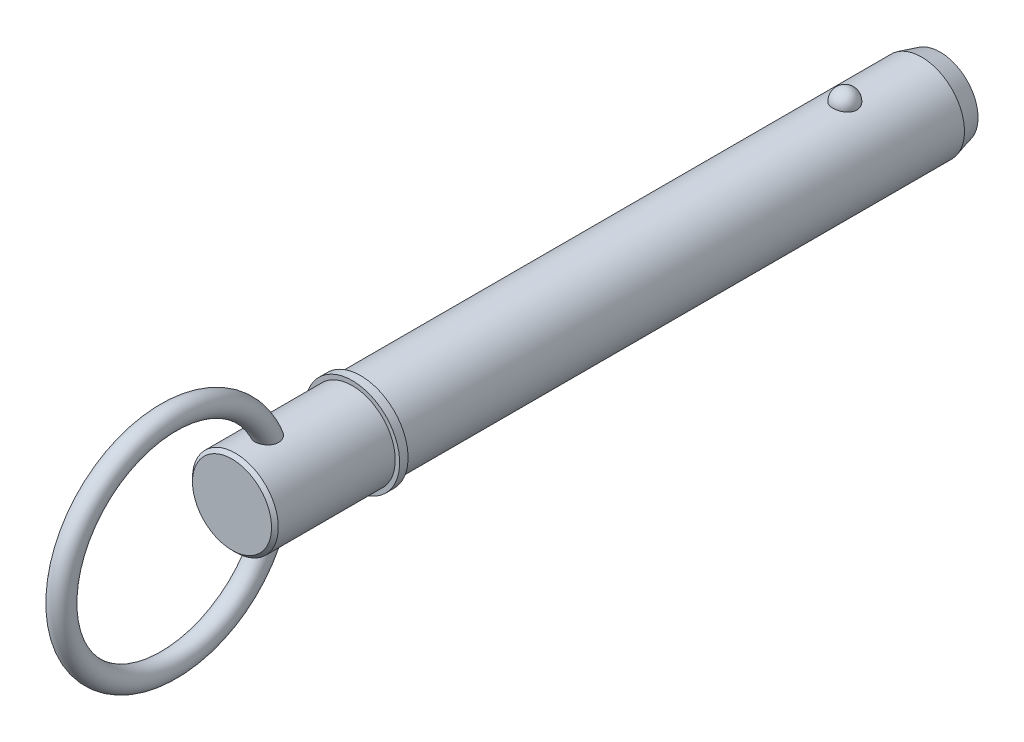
ISO-10303-21;
HEADER;
FILE_DESCRIPTION(('STEP AP214'),'2;1');
FILE_NAME('part.step','',(''),(''),'','','');
FILE_SCHEMA(('AUTOMOTIVE_DESIGN { 1 0 10303 214 1 1 1 1 }'));
ENDSEC;
DATA;
#1=APPLICATION_CONTEXT('core data for automotive mechanical design processes');
#2=APPLICATION_PROTOCOL_DEFINITION('international standard','automotive_design',2000,#1);
#3=PRODUCT_CONTEXT('',#1,'mechanical');
#4=PRODUCT('Part','Part','',(#3));
#5=PRODUCT_RELATED_PRODUCT_CATEGORY('part','',(#4));
#6=PRODUCT_DEFINITION_FORMATION('','',#4);
#7=PRODUCT_DEFINITION_CONTEXT('part definition',#1,'design');
#8=PRODUCT_DEFINITION('design','',#6,#7);
#9=PRODUCT_DEFINITION_SHAPE('','',#8);
#10=(LENGTH_UNIT() NAMED_UNIT(*) SI_UNIT(.MILLI.,.METRE.));
#11=(NAMED_UNIT(*) PLANE_ANGLE_UNIT() SI_UNIT($,.RADIAN.));
#12=(NAMED_UNIT(*) SI_UNIT($,.STERADIAN.) SOLID_ANGLE_UNIT());
#13=UNCERTAINTY_MEASURE_WITH_UNIT(LENGTH_MEASURE(1.E-05),#10,'distance_accuracy_value','');
#14=(GEOMETRIC_REPRESENTATION_CONTEXT(3) GLOBAL_UNCERTAINTY_ASSIGNED_CONTEXT((#13)) GLOBAL_UNIT_ASSIGNED_CONTEXT((#10,
#11,#12)) REPRESENTATION_CONTEXT('',''));
#15=CARTESIAN_POINT('',(0.,0.,0.));
#16=DIRECTION('',(0.,0.,1.));
#17=DIRECTION('',(1.,0.,0.));
#18=AXIS2_PLACEMENT_3D('',#15,#16,#17);
#19=CARTESIAN_POINT('',(0.,0.,139.7));
#20=DIRECTION('',(0.,0.,-1.));
#21=DIRECTION('',(-1.,0.,0.));
#22=AXIS2_PLACEMENT_3D('',#19,#20,#21);
#23=CYLINDRICAL_SURFACE('',#22,12.7);
#24=CARTESIAN_POINT('',(3.52486003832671,12.2010393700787,-3.56));
#25=CARTESIAN_POINT('',(3.52485671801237,12.2010422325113,-3.3610062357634));
#26=CARTESIAN_POINT('',(3.50863187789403,12.2057632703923,-3.16197042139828));
#27=CARTESIAN_POINT('',(3.4441205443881,12.2241207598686,-2.76953945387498));
#28=CARTESIAN_POINT('',(3.39582213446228,12.2377605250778,-2.57614642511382));
#29=CARTESIAN_POINT('',(3.26839193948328,12.2724057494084,-2.20059799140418));
#30=CARTESIAN_POINT('',(3.18927369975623,12.2934079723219,-2.01843769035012));
#31=CARTESIAN_POINT('',(3.00217139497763,12.3404306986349,-1.6703228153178));
#32=CARTESIAN_POINT('',(2.89418796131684,12.3664510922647,-1.50436788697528));
#33=CARTESIAN_POINT('',(2.65144862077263,12.4207616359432,-1.19241975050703));
#34=CARTESIAN_POINT('',(2.51656310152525,12.4490623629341,-1.04652919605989));
#35=CARTESIAN_POINT('',(2.22383249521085,12.5046678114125,-0.779711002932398));
#36=CARTESIAN_POINT('',(2.0659873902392,12.5319725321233,-0.658783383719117));
#37=CARTESIAN_POINT('',(1.73204520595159,12.5824645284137,-0.445586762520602));
#38=CARTESIAN_POINT('',(1.55600183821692,12.6056634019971,-0.353236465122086));
#39=CARTESIAN_POINT('',(1.19021695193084,12.6454411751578,-0.199381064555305));
#40=CARTESIAN_POINT('',(1.00047694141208,12.6620208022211,-0.137872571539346));
#41=CARTESIAN_POINT('',(0.616329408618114,12.6864692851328,-0.0483191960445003));
#42=CARTESIAN_POINT('',(0.422067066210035,12.6944893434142,-0.0196927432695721));
#43=CARTESIAN_POINT('',(0.0313259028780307,12.7014637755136,0.00524116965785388));
#44=CARTESIAN_POINT('',(-0.165152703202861,12.7004190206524,0.00155173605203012));
#45=CARTESIAN_POINT('',(-0.551780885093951,12.6894611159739,-0.0377454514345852));
#46=CARTESIAN_POINT('',(-0.74198078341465,12.6796749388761,-0.0728962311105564));
#47=CARTESIAN_POINT('',(-1.11361063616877,12.6524544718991,-0.173489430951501));
#48=CARTESIAN_POINT('',(-1.29504043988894,12.6350200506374,-0.238932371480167));
#49=CARTESIAN_POINT('',(-1.64521311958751,12.5942270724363,-0.398772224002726));
#50=CARTESIAN_POINT('',(-1.81387645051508,12.5708347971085,-0.493334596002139));
#51=CARTESIAN_POINT('',(-2.13292959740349,12.5206522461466,-0.708731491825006));
#52=CARTESIAN_POINT('',(-2.28331755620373,12.4938616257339,-0.829568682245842));
#53=CARTESIAN_POINT('',(-2.56470285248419,12.4391828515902,-1.0968714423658));
#54=CARTESIAN_POINT('',(-2.69527522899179,12.4112835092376,-1.24378221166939));
#55=CARTESIAN_POINT('',(-2.93023079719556,12.3579248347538,-1.55763192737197));
#56=CARTESIAN_POINT('',(-3.03461212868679,12.3324656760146,-1.72457229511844));
#57=CARTESIAN_POINT('',(-3.21564423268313,12.2865167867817,-2.07598316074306));
#58=CARTESIAN_POINT('',(-3.29196222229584,12.2660875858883,-2.26063321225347));
#59=CARTESIAN_POINT('',(-3.41323771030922,12.2328979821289,-2.64061334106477));
#60=CARTESIAN_POINT('',(-3.45819611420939,12.2201373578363,-2.83594310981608));
#61=CARTESIAN_POINT('',(-3.51550038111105,12.2037762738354,-3.2308649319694));
#62=CARTESIAN_POINT('',(-3.5279827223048,12.200137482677,-3.43043558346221));
#63=CARTESIAN_POINT('',(-3.52041430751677,12.2023234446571,-3.8289025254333));
#64=CARTESIAN_POINT('',(-3.50036443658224,12.2081479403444,-4.02779883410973));
#65=CARTESIAN_POINT('',(-3.42842010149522,12.2285446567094,-4.41824213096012));
#66=CARTESIAN_POINT('',(-3.37668525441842,12.243073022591,-4.6098208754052));
#67=CARTESIAN_POINT('',(-3.24279085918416,12.2792134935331,-4.98132360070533));
#68=CARTESIAN_POINT('',(-3.16063009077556,12.300825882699,-5.16124711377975));
#69=CARTESIAN_POINT('',(-2.96738224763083,12.3488691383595,-5.50542856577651));
#70=CARTESIAN_POINT('',(-2.85613997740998,12.3753256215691,-5.66959579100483));
#71=CARTESIAN_POINT('',(-2.60773241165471,12.4300386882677,-5.97665065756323));
#72=CARTESIAN_POINT('',(-2.47056612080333,12.458295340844,-6.11953748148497));
#73=CARTESIAN_POINT('',(-2.17327999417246,12.5135827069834,-6.38059312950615));
#74=CARTESIAN_POINT('',(-2.01307652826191,12.5406084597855,-6.49866785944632));
#75=CARTESIAN_POINT('',(-1.67442544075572,12.5902954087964,-6.70609314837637));
#76=CARTESIAN_POINT('',(-1.49597909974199,12.6129569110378,-6.79544572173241));
#77=CARTESIAN_POINT('',(-1.12819666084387,12.6511224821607,-6.94192787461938));
#78=CARTESIAN_POINT('',(-0.93902400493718,12.666712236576,-6.99944518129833));
#79=CARTESIAN_POINT('',(-0.553267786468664,12.6894125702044,-7.08227444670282));
#80=CARTESIAN_POINT('',(-0.356685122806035,12.6965241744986,-7.10759029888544));
#81=CARTESIAN_POINT('',(0.0343320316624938,12.7014305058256,-7.12510946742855));
#82=CARTESIAN_POINT('',(0.228736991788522,12.6993986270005,-7.11792901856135));
#83=CARTESIAN_POINT('',(0.613493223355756,12.6866339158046,-7.07206766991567));
#84=CARTESIAN_POINT('',(0.803844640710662,12.6759013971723,-7.03338790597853));
#85=CARTESIAN_POINT('',(1.17440741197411,12.6469443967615,-6.925834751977));
#86=CARTESIAN_POINT('',(1.35465462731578,12.6287486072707,-6.85707692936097));
#87=CARTESIAN_POINT('',(1.70092526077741,12.5867908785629,-6.69128257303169));
#88=CARTESIAN_POINT('',(1.86694777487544,12.5630285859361,-6.59424424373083));
#89=CARTESIAN_POINT('',(2.18289085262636,12.5120350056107,-6.3727748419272));
#90=CARTESIAN_POINT('',(2.33252391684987,12.4847559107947,-6.24794475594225));
#91=CARTESIAN_POINT('',(2.60889724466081,12.4299457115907,-5.97511730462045));
#92=CARTESIAN_POINT('',(2.73563353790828,12.4024145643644,-5.82711592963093));
#93=CARTESIAN_POINT('',(2.96505559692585,12.3495984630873,-5.5091226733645));
#94=CARTESIAN_POINT('',(3.06728335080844,12.3243610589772,-5.33879227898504));
#95=CARTESIAN_POINT('',(3.24218794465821,12.2795120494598,-4.98295005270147));
#96=CARTESIAN_POINT('',(3.31487538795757,12.2598984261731,-4.79744369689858));
#97=CARTESIAN_POINT('',(3.42255689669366,12.2302435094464,-4.43775244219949));
#98=CARTESIAN_POINT('',(3.46085292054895,12.2193780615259,-4.264615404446));
#99=CARTESIAN_POINT('',(3.5120056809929,12.2047747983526,-3.9143299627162));
#100=CARTESIAN_POINT('',(3.52486299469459,12.2010368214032,-3.73718164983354));
#101=CARTESIAN_POINT('',(3.52486003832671,12.2010393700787,-3.56));
#102=B_SPLINE_CURVE_WITH_KNOTS('',3,(#24,#25,#26,#27,#28,#29,#30,#31,#32,#33,#34,#35,#36,#37,
#38,#39,#40,#41,#42,#43,#44,#45,#46,#47,#48,#49,#50,#51,#52,#53,#54,#55,#56,#57,#58,#59,#60,#61,
#62,#63,#64,#65,#66,#67,#68,#69,#70,#71,#72,#73,#74,#75,#76,#77,#78,#79,#80,#81,#82,#83,#84,#85,
#86,#87,#88,#89,#90,#91,#92,#93,#94,#95,#96,#97,#98,#99,#100,#101),.UNSPECIFIED.,.T.,.F.,(4,2,2,
2,2,2,2,2,2,2,2,2,2,2,2,2,2,2,2,2,2,2,2,2,2,2,2,2,2,2,2,2,2,2,2,2,2,2,4),(0.,0.596344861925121,
1.19291141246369,1.78921606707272,2.38550767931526,2.98474477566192,3.58398233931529,
4.18149920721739,4.77895038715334,5.36566361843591,5.95232045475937,6.53059198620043,
7.10887345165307,7.6905033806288,8.27219236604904,8.86498552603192,9.45782077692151,
10.0574751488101,10.6571122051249,11.2542252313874,11.8513220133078,12.4454353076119,
13.0395724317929,13.636947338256,14.2343451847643,14.8339691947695,15.4335511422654,
16.0256602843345,16.6176978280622,17.1985559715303,17.7793931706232,18.3580179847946,
18.9366795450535,19.5242567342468,20.1119357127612,20.7098642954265,21.3075780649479,
21.8385683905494,22.3695466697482),.UNSPECIFIED.);
#103=CARTESIAN_POINT('',(3.52486003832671,12.2010393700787,-3.56));
#104=VERTEX_POINT('',#103);
#105=EDGE_CURVE('E101',#104,#104,#102,.T.);
#106=ORIENTED_EDGE('',*,*,#105,.T.);
#107=EDGE_LOOP('',(#106));
#108=FACE_BOUND('',#107,.T.);
#109=CARTESIAN_POINT('',(0.,0.,-26.25));
#110=DIRECTION('',(0.,0.,-1.));
#111=DIRECTION('',(-1.,0.,0.));
#112=AXIS2_PLACEMENT_3D('',#109,#110,#111);
#113=CIRCLE('',#112,12.7);
#114=CARTESIAN_POINT('',(-12.7,0.,-26.25));
#115=VERTEX_POINT('',#114);
#116=EDGE_CURVE('E108',#115,#115,#113,.F.);
#117=ORIENTED_EDGE('',*,*,#116,.T.);
#118=EDGE_LOOP('',(#117));
#119=FACE_BOUND('',#118,.T.);
#120=CARTESIAN_POINT('',(0.,0.,139.7));
#121=DIRECTION('',(0.,0.,1.));
#122=DIRECTION('',(1.,0.,0.));
#123=AXIS2_PLACEMENT_3D('',#120,#121,#122);
#124=CIRCLE('',#123,12.7);
#125=CARTESIAN_POINT('',(12.7,0.,139.7));
#126=VERTEX_POINT('',#125);
#127=EDGE_CURVE('E106',#126,#126,#124,.T.);
#128=ORIENTED_EDGE('',*,*,#127,.F.);
#129=EDGE_LOOP('',(#128));
#130=FACE_BOUND('',#129,.T.);
#131=ADVANCED_FACE('F39',(#108,#119,#130),#23,.T.);
#132=CARTESIAN_POINT('',(0.,0.,-31.75));
#133=DIRECTION('',(0.,0.,-1.));
#134=DIRECTION('',(-1.,0.,0.));
#135=AXIS2_PLACEMENT_3D('',#132,#133,#134);
#136=PLANE('',#135);
#137=CARTESIAN_POINT('',(0.,0.,-31.75));
#138=DIRECTION('',(0.,0.,-1.));
#139=DIRECTION('',(-1.,0.,0.));
#140=AXIS2_PLACEMENT_3D('',#137,#138,#139);
#141=CIRCLE('',#140,11.2262794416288);
#142=CARTESIAN_POINT('',(-11.2262794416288,0.,-31.75));
#143=VERTEX_POINT('',#142);
#144=EDGE_CURVE('E142',#143,#143,#141,.T.);
#145=ORIENTED_EDGE('',*,*,#144,.T.);
#146=EDGE_LOOP('',(#145));
#147=FACE_BOUND('',#146,.T.);
#148=ADVANCED_FACE('F87',(#147),#136,.T.);
#149=CARTESIAN_POINT('',(0.,0.,-31.75));
#150=DIRECTION('',(0.,0.,1.));
#151=DIRECTION('',(1.,0.,0.));
#152=AXIS2_PLACEMENT_3D('',#149,#150,#151);
#153=CONICAL_SURFACE('',#152,11.2262794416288,0.261799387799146);
#154=ORIENTED_EDGE('',*,*,#116,.F.);
#155=EDGE_LOOP('',(#154));
#156=FACE_BOUND('',#155,.T.);
#157=ORIENTED_EDGE('',*,*,#144,.F.);
#158=EDGE_LOOP('',(#157));
#159=FACE_BOUND('',#158,.T.);
#160=ADVANCED_FACE('F93',(#156,#159),#153,.T.);
#161=CARTESIAN_POINT('',(0.,12.7,-3.56));
#162=DIRECTION('',(0.,1.,0.));
#163=DIRECTION('',(0.,0.,1.));
#164=AXIS2_PLACEMENT_3D('',#161,#162,#163);
#165=SPHERICAL_SURFACE('',#164,3.56);
#166=ORIENTED_EDGE('',*,*,#105,.F.);
#167=EDGE_LOOP('',(#166));
#168=FACE_BOUND('',#167,.T.);
#169=ADVANCED_FACE('F111',(#168),#165,.T.);
#170=CARTESIAN_POINT('',(0.,0.,139.7));
#171=DIRECTION('',(0.,0.,-1.));
#172=DIRECTION('',(-1.,0.,0.));
#173=AXIS2_PLACEMENT_3D('',#170,#171,#172);
#174=PLANE('',#173);
#175=ORIENTED_EDGE('',*,*,#127,.T.);
#176=EDGE_LOOP('',(#175));
#177=FACE_BOUND('',#176,.T.);
#178=CARTESIAN_POINT('',(0.,0.,139.7));
#179=DIRECTION('',(0.,0.,-1.));
#180=DIRECTION('',(-1.,0.,0.));
#181=AXIS2_PLACEMENT_3D('',#178,#179,#180);
#182=CIRCLE('',#181,14.);
#183=CARTESIAN_POINT('',(-14.,0.,139.7));
#184=VERTEX_POINT('',#183);
#185=EDGE_CURVE('E107',#184,#184,#182,.T.);
#186=ORIENTED_EDGE('',*,*,#185,.T.);
#187=EDGE_LOOP('',(#186));
#188=FACE_BOUND('',#187,.T.);
#189=ADVANCED_FACE('F115',(#177,#188),#174,.T.);
#190=CARTESIAN_POINT('',(0.,0.,33.7287874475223));
#191=DIRECTION('',(0.,0.,-1.));
#192=DIRECTION('',(-1.,0.,0.));
#193=AXIS2_PLACEMENT_3D('',#190,#191,#192);
#194=CYLINDRICAL_SURFACE('',#193,14.);
#195=CARTESIAN_POINT('',(0.,0.,142.2));
#196=DIRECTION('',(0.,0.,-1.));
#197=DIRECTION('',(-1.,0.,0.));
#198=AXIS2_PLACEMENT_3D('',#195,#196,#197);
#199=CIRCLE('',#198,14.);
#200=CARTESIAN_POINT('',(-14.,0.,142.2));
#201=VERTEX_POINT('',#200);
#202=EDGE_CURVE('E132',#201,#201,#199,.T.);
#203=ORIENTED_EDGE('',*,*,#202,.T.);
#204=EDGE_LOOP('',(#203));
#205=FACE_BOUND('',#204,.T.);
#206=ORIENTED_EDGE('',*,*,#185,.F.);
#207=EDGE_LOOP('',(#206));
#208=FACE_BOUND('',#207,.T.);
#209=ADVANCED_FACE('F119',(#205,#208),#194,.T.);
#210=CARTESIAN_POINT('',(0.,14.,142.2));
#211=DIRECTION('',(0.,0.,1.));
#212=DIRECTION('',(1.,0.,0.));
#213=AXIS2_PLACEMENT_3D('',#210,#211,#212);
#214=PLANE('',#213);
#215=CARTESIAN_POINT('',(0.,0.,142.2));
#216=DIRECTION('',(0.,0.,1.));
#217=DIRECTION('',(1.,0.,0.));
#218=AXIS2_PLACEMENT_3D('',#215,#216,#217);
#219=CIRCLE('',#218,12.7);
#220=CARTESIAN_POINT('',(12.7,0.,142.2));
#221=VERTEX_POINT('',#220);
#222=EDGE_CURVE('E110',#221,#221,#219,.T.);
#223=ORIENTED_EDGE('',*,*,#222,.F.);
#224=EDGE_LOOP('',(#223));
#225=FACE_BOUND('',#224,.T.);
#226=ORIENTED_EDGE('',*,*,#202,.F.);
#227=EDGE_LOOP('',(#226));
#228=FACE_BOUND('',#227,.T.);
#229=ADVANCED_FACE('F84',(#225,#228),#214,.T.);
#230=CARTESIAN_POINT('',(0.,0.,177.8));
#231=DIRECTION('',(0.,0.,-1.));
#232=DIRECTION('',(-1.,0.,0.));
#233=AXIS2_PLACEMENT_3D('',#230,#231,#232);
#234=CYLINDRICAL_SURFACE('',#233,12.7);
#235=CARTESIAN_POINT('',(-1.22892607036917,-12.6404011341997,164.17119395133));
#236=CARTESIAN_POINT('',(-1.06119922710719,-12.6567092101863,164.104004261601));
#237=CARTESIAN_POINT('',(-0.887663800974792,-12.6701810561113,164.050792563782));
#238=CARTESIAN_POINT('',(-0.533823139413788,-12.6900116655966,163.973419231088));
#239=CARTESIAN_POINT('',(-0.353518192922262,-12.6963707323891,163.9492563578));
#240=CARTESIAN_POINT('',(0.00871153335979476,-12.7012887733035,163.930519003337));
#241=CARTESIAN_POINT('',(0.190636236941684,-12.699848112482,163.935943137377));
#242=CARTESIAN_POINT('',(0.550971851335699,-12.6893231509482,163.976255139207));
#243=CARTESIAN_POINT('',(0.729382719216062,-12.6802387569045,164.01114336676));
#244=CARTESIAN_POINT('',(1.0777168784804,-12.6553960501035,164.109659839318));
#245=CARTESIAN_POINT('',(1.24763507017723,-12.6396337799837,164.173305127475));
#246=CARTESIAN_POINT('',(1.57398922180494,-12.6031560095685,164.327891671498));
#247=CARTESIAN_POINT('',(1.73042571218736,-12.5824407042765,164.418831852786));
#248=CARTESIAN_POINT('',(2.02464767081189,-12.5384554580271,164.625320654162));
#249=CARTESIAN_POINT('',(2.16251370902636,-12.5151974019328,164.74075697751));
#250=CARTESIAN_POINT('',(2.41652917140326,-12.4686447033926,164.993426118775));
#251=CARTESIAN_POINT('',(2.53268123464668,-12.4453500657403,165.130656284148));
#252=CARTESIAN_POINT('',(2.7397169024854,-12.4014166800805,165.42226178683));
#253=CARTESIAN_POINT('',(2.83072997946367,-12.3807646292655,165.576543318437));
#254=CARTESIAN_POINT('',(2.98642630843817,-12.3441356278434,165.898338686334));
#255=CARTESIAN_POINT('',(3.05110876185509,-12.3281588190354,166.065852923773));
#256=CARTESIAN_POINT('',(3.15450336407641,-12.3021148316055,166.412705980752));
#257=CARTESIAN_POINT('',(3.19268116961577,-12.2921697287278,166.592212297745));
#258=CARTESIAN_POINT('',(3.24150148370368,-12.2793848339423,166.955144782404));
#259=CARTESIAN_POINT('',(3.25213515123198,-12.2765473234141,167.138572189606));
#260=CARTESIAN_POINT('',(3.24696781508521,-12.2779158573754,167.518893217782));
#261=CARTESIAN_POINT('',(3.22910261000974,-12.2826719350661,167.715753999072));
#262=CARTESIAN_POINT('',(3.1650495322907,-12.2993299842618,168.10447917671));
#263=CARTESIAN_POINT('',(3.11884966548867,-12.3112349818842,168.296341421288));
#264=CARTESIAN_POINT('',(2.99323123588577,-12.3424162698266,168.692891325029));
#265=CARTESIAN_POINT('',(2.91059577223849,-12.3623844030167,168.896505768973));
#266=CARTESIAN_POINT('',(2.71447440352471,-12.4069229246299,169.288190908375));
#267=CARTESIAN_POINT('',(2.60094970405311,-12.431499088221,169.476241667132));
#268=CARTESIAN_POINT('',(2.40499526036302,-12.4703951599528,169.747470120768));
#269=CARTESIAN_POINT('',(2.33301847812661,-12.4841083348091,169.838407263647));
#270=CARTESIAN_POINT('',(2.18106597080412,-12.5115521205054,170.013320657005));
#271=CARTESIAN_POINT('',(2.10108885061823,-12.5252827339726,170.097295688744));
#272=CARTESIAN_POINT('',(1.84973962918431,-12.5657115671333,170.336779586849));
#273=CARTESIAN_POINT('',(1.6664677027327,-12.5917488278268,170.480526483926));
#274=CARTESIAN_POINT('',(1.33551340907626,-12.6303067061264,170.685856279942));
#275=CARTESIAN_POINT('',(1.19512135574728,-12.6444898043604,170.75902243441));
#276=CARTESIAN_POINT('',(0.903945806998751,-12.6686276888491,170.881586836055));
#277=CARTESIAN_POINT('',(0.753173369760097,-12.6785868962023,170.931009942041));
#278=CARTESIAN_POINT('',(0.444090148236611,-12.6931800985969,171.002942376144));
#279=CARTESIAN_POINT('',(0.285741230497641,-12.6977833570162,171.025296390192));
#280=CARTESIAN_POINT('',(-0.0324491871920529,-12.700953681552,171.040724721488));
#281=CARTESIAN_POINT('',(-0.192290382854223,-12.6995219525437,171.033804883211));
#282=CARTESIAN_POINT('',(-0.493822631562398,-12.6912132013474,170.993209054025));
#283=CARTESIAN_POINT('',(-0.635865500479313,-12.6848307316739,170.961962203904));
#284=CARTESIAN_POINT('',(-0.913041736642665,-12.6678986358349,170.877721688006));
#285=CARTESIAN_POINT('',(-1.04817349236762,-12.6573480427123,170.824722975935));
#286=CARTESIAN_POINT('',(-1.31637898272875,-12.6323524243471,170.696233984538));
#287=CARTESIAN_POINT('',(-1.44890088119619,-12.6177203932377,170.619638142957));
#288=CARTESIAN_POINT('',(-1.70162176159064,-12.5861326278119,170.448743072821));
#289=CARTESIAN_POINT('',(-1.82181486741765,-12.569175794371,170.354435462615));
#290=CARTESIAN_POINT('',(-2.06961284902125,-12.5309682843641,170.132665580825));
#291=CARTESIAN_POINT('',(-2.1945762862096,-12.5094982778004,170.00229330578));
#292=CARTESIAN_POINT('',(-2.4250376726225,-12.4668738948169,169.725308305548));
#293=CARTESIAN_POINT('',(-2.53052086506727,-12.4457197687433,169.578683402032));
#294=CARTESIAN_POINT('',(-2.73961150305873,-12.4015349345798,169.243065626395));
#295=CARTESIAN_POINT('',(-2.83895917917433,-12.3789253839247,169.051346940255));
#296=CARTESIAN_POINT('',(-3.00725804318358,-12.3391195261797,168.654405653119));
#297=CARTESIAN_POINT('',(-3.07618857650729,-12.3219268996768,168.449173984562));
#298=CARTESIAN_POINT('',(-3.18528660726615,-12.2942052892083,168.013754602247));
#299=CARTESIAN_POINT('',(-3.22287145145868,-12.2842816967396,167.782855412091));
#300=CARTESIAN_POINT('',(-3.24821271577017,-12.2775854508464,167.434351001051));
#301=CARTESIAN_POINT('',(-3.25148236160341,-12.276719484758,167.317777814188));
#302=CARTESIAN_POINT('',(-3.24729041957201,-12.2778310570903,167.084859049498));
#303=CARTESIAN_POINT('',(-3.23983534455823,-12.2798068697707,166.968513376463));
#304=CARTESIAN_POINT('',(-3.21488959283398,-12.286359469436,166.74622762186));
#305=CARTESIAN_POINT('',(-3.19823165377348,-12.2907201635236,166.640186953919));
#306=CARTESIAN_POINT('',(-3.15537465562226,-12.3017926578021,166.43022257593));
#307=CARTESIAN_POINT('',(-3.12918076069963,-12.3085031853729,166.326297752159));
#308=CARTESIAN_POINT('',(-3.06721568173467,-12.3240904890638,166.121553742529));
#309=CARTESIAN_POINT('',(-3.03144854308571,-12.3329663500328,166.020733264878));
#310=CARTESIAN_POINT('',(-2.95042598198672,-12.3525998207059,165.823171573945));
#311=CARTESIAN_POINT('',(-2.90517160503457,-12.3633572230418,165.726429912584));
#312=CARTESIAN_POINT('',(-2.81116315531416,-12.3850478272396,165.548857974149));
#313=CARTESIAN_POINT('',(-2.76340897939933,-12.3958187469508,165.467476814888));
#314=CARTESIAN_POINT('',(-2.66091958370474,-12.4182228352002,165.309317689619));
#315=CARTESIAN_POINT('',(-2.60618212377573,-12.4298562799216,165.232541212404));
#316=CARTESIAN_POINT('',(-2.49013138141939,-12.4536239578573,165.084278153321));
#317=CARTESIAN_POINT('',(-2.4288215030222,-12.4657579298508,165.012788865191));
#318=CARTESIAN_POINT('',(-2.30002146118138,-12.4901640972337,164.875587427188));
#319=CARTESIAN_POINT('',(-2.23252894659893,-12.5024363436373,164.809877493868));
#320=CARTESIAN_POINT('',(-2.09370795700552,-12.5264205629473,164.686377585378));
#321=CARTESIAN_POINT('',(-2.02252382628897,-12.5381388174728,164.628426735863));
#322=CARTESIAN_POINT('',(-1.87531735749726,-12.5610012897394,164.51889123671));
#323=CARTESIAN_POINT('',(-1.79929316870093,-12.5721452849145,164.467309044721));
#324=CARTESIAN_POINT('',(-1.5648528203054,-12.6042047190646,164.322706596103));
#325=CARTESIAN_POINT('',(-1.39990754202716,-12.6237766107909,164.239687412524));
#326=CARTESIAN_POINT('',(-1.22892607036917,-12.6404011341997,164.17119395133));
#327=B_SPLINE_CURVE_WITH_KNOTS('',3,(#235,#236,#237,#238,#239,#240,#241,#242,#243,#244,#245,
#246,#247,#248,#249,#250,#251,#252,#253,#254,#255,#256,#257,#258,#259,#260,#261,#262,#263,#264,
#265,#266,#267,#268,#269,#270,#271,#272,#273,#274,#275,#276,#277,#278,#279,#280,#281,#282,#283,
#284,#285,#286,#287,#288,#289,#290,#291,#292,#293,#294,#295,#296,#297,#298,#299,#300,#301,#302,
#303,#304,#305,#306,#307,#308,#309,#310,#311,#312,#313,#314,#315,#316,#317,#318,#319,#320,#321,
#322,#323,#324,#325,#326),.UNSPECIFIED.,.T.,.F.,(4,2,2,2,2,2,2,2,2,2,2,2,2,2,2,2,2,2,2,2,2,2,2,
2,2,2,2,2,2,2,2,2,2,2,2,2,2,2,2,2,2,2,2,2,2,4),(0.,0.543509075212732,1.08699497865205,
1.63045544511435,2.17392254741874,2.71771216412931,3.26148037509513,3.80280767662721,
4.34406914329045,4.88248866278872,5.42092451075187,5.9699227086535,6.51909710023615,
7.10988630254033,7.70092576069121,8.3601374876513,9.02018098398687,9.3700914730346,
9.72006308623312,10.4175255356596,10.8925536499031,11.3670833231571,11.844322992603,
12.3214673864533,12.7562647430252,13.1911630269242,13.6507378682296,14.110530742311,
14.6541210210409,15.1981214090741,15.8467121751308,16.4957426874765,17.1940750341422,
17.5435132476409,17.8927393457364,18.2145822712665,18.536251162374,18.8577843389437,
19.1792821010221,19.463832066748,19.7484735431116,20.0329683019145,20.3175717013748,
20.5948148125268,20.8721645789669,21.4262200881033),.UNSPECIFIED.);
#328=CARTESIAN_POINT('',(-1.22892607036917,-12.6404011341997,164.17119395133));
#329=VERTEX_POINT('',#328);
#330=EDGE_CURVE('E10',#329,#329,#327,.T.);
#331=ORIENTED_EDGE('',*,*,#330,.F.);
#332=EDGE_LOOP('',(#331));
#333=FACE_BOUND('',#332,.T.);
#334=CARTESIAN_POINT('',(-1.22892607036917,12.6404011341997,164.17119395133));
#335=CARTESIAN_POINT('',(-1.39512541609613,12.624240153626,164.23776712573));
#336=CARTESIAN_POINT('',(-1.55582432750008,12.6052778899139,164.318153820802));
#337=CARTESIAN_POINT('',(-1.86136954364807,12.5638060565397,164.504658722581));
#338=CARTESIAN_POINT('',(-2.00617769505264,12.5412882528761,164.610836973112));
#339=CARTESIAN_POINT('',(-2.27547906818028,12.4952333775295,164.846103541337));
#340=CARTESIAN_POINT('',(-2.39998742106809,12.4716970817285,164.975174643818));
#341=CARTESIAN_POINT('',(-2.62534229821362,12.4262157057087,165.252623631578));
#342=CARTESIAN_POINT('',(-2.72620384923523,12.4042696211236,165.400989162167));
#343=CARTESIAN_POINT('',(-2.90197976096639,12.3643304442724,165.7126750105));
#344=CARTESIAN_POINT('',(-2.97691335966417,12.346334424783,165.875984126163));
#345=CARTESIAN_POINT('',(-3.09983588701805,12.3160482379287,166.212927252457));
#346=CARTESIAN_POINT('',(-3.14781852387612,12.3037594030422,166.386563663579));
#347=CARTESIAN_POINT('',(-3.21809353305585,12.2855709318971,166.745523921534));
#348=CARTESIAN_POINT('',(-3.23943500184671,12.2799082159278,166.931044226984));
#349=CARTESIAN_POINT('',(-3.2544382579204,12.2759385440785,167.303232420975));
#350=CARTESIAN_POINT('',(-3.24809142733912,12.2776338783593,167.489900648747));
#351=CARTESIAN_POINT('',(-3.20755159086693,12.288291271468,167.877577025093));
#352=CARTESIAN_POINT('',(-3.17081691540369,12.2979162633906,168.078299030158));
#353=CARTESIAN_POINT('',(-3.06845850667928,12.3238513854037,168.471858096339));
#354=CARTESIAN_POINT('',(-3.00281105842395,12.3401670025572,168.664688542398));
#355=CARTESIAN_POINT('',(-2.83560995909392,12.3797223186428,169.059473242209));
#356=CARTESIAN_POINT('',(-2.73085133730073,12.4035339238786,169.260019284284));
#357=CARTESIAN_POINT('',(-2.48976141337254,12.4541651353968,169.640813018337));
#358=CARTESIAN_POINT('',(-2.35343772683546,12.4809840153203,169.821065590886));
#359=CARTESIAN_POINT('',(-2.07683984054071,12.5296806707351,170.12565995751));
#360=CARTESIAN_POINT('',(-1.94129351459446,12.551613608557,170.254283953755));
#361=CARTESIAN_POINT('',(-1.65081707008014,12.5931023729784,170.487836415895));
#362=CARTESIAN_POINT('',(-1.49591505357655,12.6126615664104,170.592798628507));
#363=CARTESIAN_POINT('',(-1.19690065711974,12.6442092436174,170.757788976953));
#364=CARTESIAN_POINT('',(-1.05541267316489,12.6569190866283,170.822418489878));
#365=CARTESIAN_POINT('',(-0.763415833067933,12.6778764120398,170.927638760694));
#366=CARTESIAN_POINT('',(-0.612913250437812,12.6861269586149,170.968246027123));
#367=CARTESIAN_POINT('',(-0.306168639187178,12.697239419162,171.022715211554));
#368=CARTESIAN_POINT('',(-0.149903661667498,12.7000767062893,171.036454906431));
#369=CARTESIAN_POINT('',(0.16255262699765,12.699920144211,171.03569423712));
#370=CARTESIAN_POINT('',(0.318743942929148,12.6969267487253,171.021196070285));
#371=CARTESIAN_POINT('',(0.614555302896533,12.6859231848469,170.967234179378));
#372=CARTESIAN_POINT('',(0.754548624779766,12.6782987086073,170.929687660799));
#373=CARTESIAN_POINT('',(1.0268504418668,12.6591561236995,170.833711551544));
#374=CARTESIAN_POINT('',(1.15915690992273,12.6476369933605,170.775276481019));
#375=CARTESIAN_POINT('',(1.42405861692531,12.6206654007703,170.634988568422));
#376=CARTESIAN_POINT('',(1.5558287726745,12.604971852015,170.551635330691));
#377=CARTESIAN_POINT('',(1.80621935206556,12.571537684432,170.367498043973));
#378=CARTESIAN_POINT('',(1.92483289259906,12.5537960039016,170.266704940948));
#379=CARTESIAN_POINT('',(2.16936918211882,12.5140714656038,170.030174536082));
#380=CARTESIAN_POINT('',(2.2923642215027,12.4919255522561,169.891439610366));
#381=CARTESIAN_POINT('',(2.51762485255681,12.4484835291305,169.597913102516));
#382=CARTESIAN_POINT('',(2.61987416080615,12.4271880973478,169.443109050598));
#383=CARTESIAN_POINT('',(2.81956306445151,12.3835520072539,169.091316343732));
#384=CARTESIAN_POINT('',(2.91268031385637,12.3617361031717,168.891798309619));
#385=CARTESIAN_POINT('',(3.06675738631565,12.3244204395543,168.479898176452));
#386=CARTESIAN_POINT('',(3.12769905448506,12.3089242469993,168.267508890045));
#387=CARTESIAN_POINT('',(3.19410612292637,12.2917937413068,167.937729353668));
#388=CARTESIAN_POINT('',(3.21217746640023,12.2870696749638,167.822917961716));
#389=CARTESIAN_POINT('',(3.23822570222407,12.2802317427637,167.592095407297));
#390=CARTESIAN_POINT('',(3.24620727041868,12.2781166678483,167.47608482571));
#391=CARTESIAN_POINT('',(3.25166839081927,12.2766712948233,167.24381042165));
#392=CARTESIAN_POINT('',(3.24914931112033,12.2773406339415,167.127546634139));
#393=CARTESIAN_POINT('',(3.23325304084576,12.2815367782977,166.895869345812));
#394=CARTESIAN_POINT('',(3.2198826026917,12.2850618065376,166.78045536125));
#395=CARTESIAN_POINT('',(3.18378347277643,12.2944635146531,166.562188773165));
#396=CARTESIAN_POINT('',(3.16203615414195,12.3000921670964,166.459162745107));
#397=CARTESIAN_POINT('',(3.10931056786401,12.3135262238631,166.255694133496));
#398=CARTESIAN_POINT('',(3.07833729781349,12.3213304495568,166.15525018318));
#399=CARTESIAN_POINT('',(3.00719503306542,12.3388864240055,165.957882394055));
#400=CARTESIAN_POINT('',(2.9670290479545,12.34863753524,165.860957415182));
#401=CARTESIAN_POINT('',(2.87766260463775,12.3697681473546,165.67155308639));
#402=CARTESIAN_POINT('',(2.82846300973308,12.3811474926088,165.579073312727));
#403=CARTESIAN_POINT('',(2.72718770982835,12.4038233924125,165.409278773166));
#404=CARTESIAN_POINT('',(2.67601025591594,12.4149937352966,165.331409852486));
#405=CARTESIAN_POINT('',(2.56702778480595,12.4379850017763,165.180514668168));
#406=CARTESIAN_POINT('',(2.5092205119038,12.4498061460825,165.107490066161));
#407=CARTESIAN_POINT('',(2.38741431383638,12.4737362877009,164.966915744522));
#408=CARTESIAN_POINT('',(2.32341881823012,12.4858451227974,164.899363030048));
#409=CARTESIAN_POINT('',(2.18967865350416,12.5099935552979,164.770183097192));
#410=CARTESIAN_POINT('',(2.11993188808,12.5220331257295,164.708558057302));
#411=CARTESIAN_POINT('',(1.90863625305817,12.5565453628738,164.537971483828));
#412=CARTESIAN_POINT('',(1.75996750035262,12.5784460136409,164.437508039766));
#413=CARTESIAN_POINT('',(1.44761854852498,12.6182083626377,164.262748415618));
#414=CARTESIAN_POINT('',(1.28394037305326,12.6360706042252,164.188448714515));
#415=CARTESIAN_POINT('',(0.945887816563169,12.6658634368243,164.067537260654));
#416=CARTESIAN_POINT('',(0.771499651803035,12.6777861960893,164.020962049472));
#417=CARTESIAN_POINT('',(0.417041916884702,12.694390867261,163.956673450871));
#418=CARTESIAN_POINT('',(0.23696907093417,12.6990685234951,163.938977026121));
#419=CARTESIAN_POINT('',(-0.124879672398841,12.7006841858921,163.932829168));
#420=CARTESIAN_POINT('',(-0.306658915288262,12.6975703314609,163.944573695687));
#421=CARTESIAN_POINT('',(-0.66529779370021,12.6838264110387,163.997473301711));
#422=CARTESIAN_POINT('',(-0.842168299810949,12.6732146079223,164.038556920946));
#423=CARTESIAN_POINT('',(-1.05025519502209,12.6565519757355,164.105394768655));
#424=CARTESIAN_POINT('',(-1.08632235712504,12.6535053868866,164.117681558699));
#425=CARTESIAN_POINT('',(-1.15798463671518,12.6471484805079,164.143501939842));
#426=CARTESIAN_POINT('',(-1.19357974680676,12.643838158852,164.15703555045));
#427=CARTESIAN_POINT('',(-1.22892607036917,12.6404011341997,164.17119395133));
#428=B_SPLINE_CURVE_WITH_KNOTS('',3,(#334,#335,#336,#337,#338,#339,#340,#341,#342,#343,#344,
#345,#346,#347,#348,#349,#350,#351,#352,#353,#354,#355,#356,#357,#358,#359,#360,#361,#362,#363,
#364,#365,#366,#367,#368,#369,#370,#371,#372,#373,#374,#375,#376,#377,#378,#379,#380,#381,#382,
#383,#384,#385,#386,#387,#388,#389,#390,#391,#392,#393,#394,#395,#396,#397,#398,#399,#400,#401,
#402,#403,#404,#405,#406,#407,#408,#409,#410,#411,#412,#413,#414,#415,#416,#417,#418,#419,#420,
#421,#422,#423,#424,#425,#426,#427),.UNSPECIFIED.,.T.,.F.,(4,2,2,2,2,2,2,2,2,2,2,2,2,2,2,2,2,2,
2,2,2,2,2,2,2,2,2,2,2,2,2,2,2,2,2,2,2,2,2,2,2,2,2,2,2,2,4),(0.,0.539146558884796,
1.07956050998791,1.61956978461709,2.15923496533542,2.69849886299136,3.23788860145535,
3.79602631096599,4.3543377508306,4.96471598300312,5.57559579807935,6.25509482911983,
6.93443009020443,7.49671429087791,8.05819140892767,8.52445959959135,8.99040698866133,
9.45846913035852,9.92649485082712,10.3600530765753,10.7937251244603,11.2621204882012,
11.7307597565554,12.2888675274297,12.8474116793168,13.5084064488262,14.1697737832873,
14.5183408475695,14.8667463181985,15.2151063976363,15.5632498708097,15.8791508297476,
16.1948809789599,16.5105079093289,16.826104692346,17.1072964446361,17.3885841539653,
17.669716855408,17.9509524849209,18.490448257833,19.0298713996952,19.5700039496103,
20.1104536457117,20.6545101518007,21.1972460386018,21.3119068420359,21.4265694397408),.UNSPECIFIED.);
#429=CARTESIAN_POINT('',(-1.22892607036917,12.6404011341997,164.17119395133));
#430=VERTEX_POINT('',#429);
#431=EDGE_CURVE('E51',#430,#430,#428,.T.);
#432=ORIENTED_EDGE('',*,*,#431,.F.);
#433=EDGE_LOOP('',(#432));
#434=FACE_BOUND('',#433,.T.);
#435=CARTESIAN_POINT('',(0.,0.,176.8));
#436=DIRECTION('',(0.,0.,-1.));
#437=DIRECTION('',(-1.,0.,0.));
#438=AXIS2_PLACEMENT_3D('',#435,#436,#437);
#439=CIRCLE('',#438,12.7);
#440=CARTESIAN_POINT('',(-12.7,0.,176.8));
#441=VERTEX_POINT('',#440);
#442=EDGE_CURVE('E63',#441,#441,#439,.T.);
#443=ORIENTED_EDGE('',*,*,#442,.T.);
#444=EDGE_LOOP('',(#443));
#445=FACE_BOUND('',#444,.T.);
#446=ORIENTED_EDGE('',*,*,#222,.T.);
#447=EDGE_LOOP('',(#446));
#448=FACE_BOUND('',#447,.T.);
#449=ADVANCED_FACE('F68',(#333,#434,#445,#448),#234,.T.);
#450=CARTESIAN_POINT('',(0.,0.,177.8));
#451=DIRECTION('',(0.,0.,-1.));
#452=DIRECTION('',(-1.,0.,0.));
#453=AXIS2_PLACEMENT_3D('',#450,#451,#452);
#454=PLANE('',#453);
#455=CARTESIAN_POINT('',(0.,0.,177.8));
#456=DIRECTION('',(0.,0.,-1.));
#457=DIRECTION('',(-1.,0.,0.));
#458=AXIS2_PLACEMENT_3D('',#455,#456,#457);
#459=CIRCLE('',#458,11.7);
#460=CARTESIAN_POINT('',(-11.7,0.,177.8));
#461=VERTEX_POINT('',#460);
#462=EDGE_CURVE('E57',#461,#461,#459,.F.);
#463=ORIENTED_EDGE('',*,*,#462,.T.);
#464=EDGE_LOOP('',(#463));
#465=FACE_BOUND('',#464,.T.);
#466=ADVANCED_FACE('F75',(#465),#454,.F.);
#467=CARTESIAN_POINT('',(0.,0.,176.8));
#468=DIRECTION('',(0.,0.,-1.));
#469=DIRECTION('',(-1.,0.,0.));
#470=AXIS2_PLACEMENT_3D('',#467,#468,#469);
#471=CONICAL_SURFACE('',#470,12.7,0.785398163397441);
#472=ORIENTED_EDGE('',*,*,#462,.F.);
#473=EDGE_LOOP('',(#472));
#474=FACE_BOUND('',#473,.T.);
#475=ORIENTED_EDGE('',*,*,#442,.F.);
#476=EDGE_LOOP('',(#475));
#477=FACE_BOUND('',#476,.T.);
#478=ADVANCED_FACE('F41',(#474,#477),#471,.T.);
#479=CARTESIAN_POINT('',(0.,0.,196.55));
#480=DIRECTION('',(1.,0.,0.));
#481=DIRECTION('',(0.,0.,-1.));
#482=AXIS2_PLACEMENT_3D('',#479,#480,#481);
#483=TOROIDAL_SURFACE('',#482,31.75,3.25);
#484=ORIENTED_EDGE('',*,*,#330,.T.);
#485=EDGE_LOOP('',(#484));
#486=FACE_BOUND('',#485,.T.);
#487=ORIENTED_EDGE('',*,*,#431,.T.);
#488=EDGE_LOOP('',(#487));
#489=FACE_BOUND('',#488,.T.);
#490=ADVANCED_FACE('F72',(#486,#489),#483,.T.);
#491=CLOSED_SHELL('',(#131,#148,#160,#169,#189,#209,#229,#449,#466,#478,#490));
#492=MANIFOLD_SOLID_BREP('B2',#491);
#493=ADVANCED_BREP_SHAPE_REPRESENTATION('',(#18,#492),#14);
#494=SHAPE_DEFINITION_REPRESENTATION(#9,#493);
ENDSEC;
END-ISO-10303-21;
